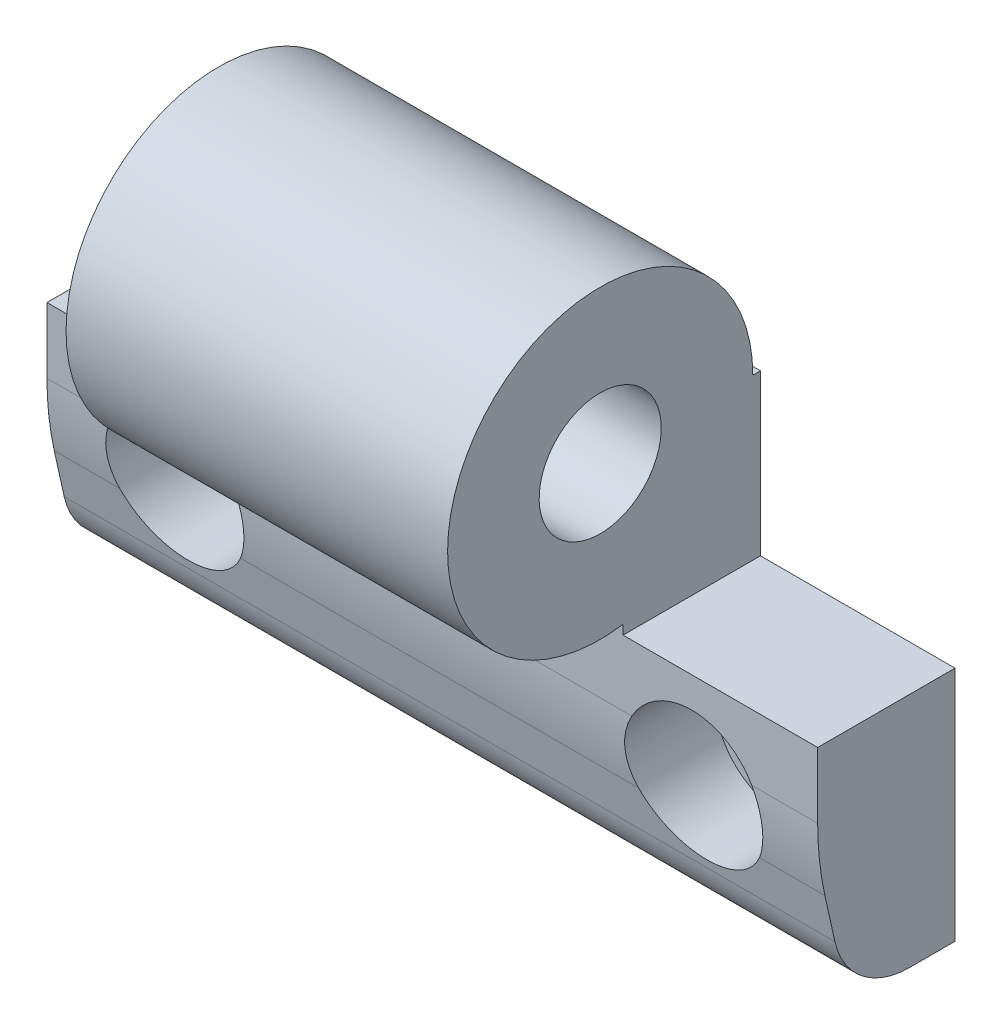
ISO-10303-21;
HEADER;
FILE_DESCRIPTION(('STEP AP214'),'2;1');
FILE_NAME('part.step','',(''),(''),'','','');
FILE_SCHEMA(('AUTOMOTIVE_DESIGN { 1 0 10303 214 1 1 1 1 }'));
ENDSEC;
DATA;
#1=APPLICATION_CONTEXT('core data for automotive mechanical design processes');
#2=APPLICATION_PROTOCOL_DEFINITION('international standard','automotive_design',2000,#1);
#3=PRODUCT_CONTEXT('',#1,'mechanical');
#4=PRODUCT('Part','Part','',(#3));
#5=PRODUCT_RELATED_PRODUCT_CATEGORY('part','',(#4));
#6=PRODUCT_DEFINITION_FORMATION('','',#4);
#7=PRODUCT_DEFINITION_CONTEXT('part definition',#1,'design');
#8=PRODUCT_DEFINITION('design','',#6,#7);
#9=PRODUCT_DEFINITION_SHAPE('','',#8);
#10=(LENGTH_UNIT() NAMED_UNIT(*) SI_UNIT(.MILLI.,.METRE.));
#11=(NAMED_UNIT(*) PLANE_ANGLE_UNIT() SI_UNIT($,.RADIAN.));
#12=(NAMED_UNIT(*) SI_UNIT($,.STERADIAN.) SOLID_ANGLE_UNIT());
#13=UNCERTAINTY_MEASURE_WITH_UNIT(LENGTH_MEASURE(1.E-05),#10,'distance_accuracy_value','');
#14=(GEOMETRIC_REPRESENTATION_CONTEXT(3) GLOBAL_UNCERTAINTY_ASSIGNED_CONTEXT((#13)) GLOBAL_UNIT_ASSIGNED_CONTEXT((#10,
#11,#12)) REPRESENTATION_CONTEXT('',''));
#15=CARTESIAN_POINT('',(0.,0.,0.));
#16=DIRECTION('',(0.,0.,1.));
#17=DIRECTION('',(1.,0.,0.));
#18=AXIS2_PLACEMENT_3D('',#15,#16,#17);
#19=CARTESIAN_POINT('',(43.5,2.19544457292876,-10.9999999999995));
#20=DIRECTION('',(-1.,0.,0.));
#21=DIRECTION('',(0.,-1.,0.));
#22=AXIS2_PLACEMENT_3D('',#19,#20,#21);
#23=CYLINDRICAL_SURFACE('',#22,19.9999999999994);
#24=CARTESIAN_POINT('',(30.0718931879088,2.19544457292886,9.));
#25=CARTESIAN_POINT('',(30.0112249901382,2.08692436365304,9.00000772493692));
#26=CARTESIAN_POINT('',(29.9550790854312,1.97587926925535,8.99911700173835));
#27=CARTESIAN_POINT('',(29.8521731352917,1.74955813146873,8.99534729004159));
#28=CARTESIAN_POINT('',(29.8054128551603,1.63428219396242,8.99246835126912));
#29=CARTESIAN_POINT('',(29.7217321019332,1.40063584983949,8.98454182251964));
#30=CARTESIAN_POINT('',(29.6847848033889,1.28227487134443,8.97950024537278));
#31=CARTESIAN_POINT('',(29.6208009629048,1.04305545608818,8.96713248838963));
#32=CARTESIAN_POINT('',(29.5937641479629,0.922197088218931,8.95980637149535));
#33=CARTESIAN_POINT('',(29.5277604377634,0.556948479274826,8.93425805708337));
#34=CARTESIAN_POINT('',(29.5039054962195,0.309899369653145,8.91246636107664));
#35=CARTESIAN_POINT('',(29.496976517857,-0.183901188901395,8.85951756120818));
#36=CARTESIAN_POINT('',(29.5139312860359,-0.430652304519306,8.82835385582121));
#37=CARTESIAN_POINT('',(29.5702101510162,-0.802504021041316,8.77446354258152));
#38=CARTESIAN_POINT('',(29.5953000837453,-0.930344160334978,8.75464210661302));
#39=CARTESIAN_POINT('',(29.656367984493,-1.1831099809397,8.71298410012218));
#40=CARTESIAN_POINT('',(29.6923473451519,-1.30803528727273,8.69114727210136));
#41=CARTESIAN_POINT('',(29.7748952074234,-1.55414052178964,8.64576985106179));
#42=CARTESIAN_POINT('',(29.8214736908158,-1.67531679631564,8.6222276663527));
#43=CARTESIAN_POINT('',(29.9247856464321,-1.91296483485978,8.57385420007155));
#44=CARTESIAN_POINT('',(29.9815171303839,-2.02943751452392,8.54902317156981));
#45=CARTESIAN_POINT('',(30.0431267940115,-2.14316458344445,8.52374120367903));
#46=B_SPLINE_CURVE_WITH_KNOTS('',3,(#24,#25,#26,#27,#28,#29,#30,#31,#32,#33,#34,#35,#36,#37,#38,
#39,#40,#41,#42,#43,#44,#45),.UNSPECIFIED.,.F.,.F.,(4,2,2,2,2,2,2,2,2,2,4),(0.,
0.372866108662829,0.745722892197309,1.11754966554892,1.48936619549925,2.23304529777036,
2.97724947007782,3.37215823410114,3.7671175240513,4.16245031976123,4.55770578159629),.UNSPECIFIED.);
#47=CARTESIAN_POINT('',(30.0718931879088,2.19544457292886,9.));
#48=VERTEX_POINT('',#47);
#49=CARTESIAN_POINT('',(30.0431267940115,-2.14316458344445,8.52374120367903));
#50=VERTEX_POINT('',#49);
#51=EDGE_CURVE('E126',#48,#50,#46,.T.);
#52=ORIENTED_EDGE('',*,*,#51,.F.);
#53=DIRECTION('',(-1.,0.,0.));
#54=VECTOR('',#53,1.);
#55=CARTESIAN_POINT('',(43.5,2.19544457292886,9.));
#56=LINE('',#55,#54);
#57=CARTESIAN_POINT('',(3.9281068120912,2.19544457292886,9.));
#58=VERTEX_POINT('',#57);
#59=EDGE_CURVE('E36',#48,#58,#56,.T.);
#60=ORIENTED_EDGE('',*,*,#59,.T.);
#61=CARTESIAN_POINT('',(3.95687320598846,-2.14316458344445,8.52374120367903));
#62=CARTESIAN_POINT('',(4.01660703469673,-2.03290070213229,8.54825287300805));
#63=CARTESIAN_POINT('',(4.07175599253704,-1.92005304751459,8.57234171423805));
#64=CARTESIAN_POINT('',(4.17252019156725,-1.68992066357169,8.61931803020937));
#65=CARTESIAN_POINT('',(4.21813419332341,-1.5726353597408,8.64220534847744));
#66=CARTESIAN_POINT('',(4.29943126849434,-1.334438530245,8.68640682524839));
#67=CARTESIAN_POINT('',(4.33511861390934,-1.21352858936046,8.70772165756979));
#68=CARTESIAN_POINT('',(4.39627456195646,-0.968849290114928,8.7484839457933));
#69=CARTESIAN_POINT('',(4.42174380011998,-0.845080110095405,8.76793151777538));
#70=CARTESIAN_POINT('',(4.46224845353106,-0.595295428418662,8.80474026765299));
#71=CARTESIAN_POINT('',(4.47726432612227,-0.469276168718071,8.82209748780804));
#72=CARTESIAN_POINT('',(4.49659922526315,-0.216123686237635,8.85448616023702));
#73=CARTESIAN_POINT('',(4.50091849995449,-0.0889904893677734,8.86951766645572));
#74=CARTESIAN_POINT('',(4.49875711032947,0.165403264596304,8.89711776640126));
#75=CARTESIAN_POINT('',(4.49228061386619,0.292663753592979,8.90968730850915));
#76=CARTESIAN_POINT('',(4.46852718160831,0.546337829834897,8.93230178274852));
#77=CARTESIAN_POINT('',(4.45125551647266,0.672751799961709,8.94234794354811));
#78=CARTESIAN_POINT('',(4.4066510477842,0.920202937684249,8.95967676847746));
#79=CARTESIAN_POINT('',(4.37962254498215,1.04129006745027,8.96703073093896));
#80=CARTESIAN_POINT('',(4.31562303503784,1.28092962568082,8.97944103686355));
#81=CARTESIAN_POINT('',(4.27865198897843,1.39948204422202,8.98449737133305));
#82=CARTESIAN_POINT('',(4.19490150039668,1.63348536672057,8.99244659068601));
#83=CARTESIAN_POINT('',(4.14809727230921,1.74892758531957,8.99533392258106));
#84=CARTESIAN_POINT('',(4.045076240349,1.9755734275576,8.99911477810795));
#85=CARTESIAN_POINT('',(3.98885899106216,2.0867768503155,9.00000820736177));
#86=CARTESIAN_POINT('',(3.9281068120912,2.19544457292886,9.));
#87=B_SPLINE_CURVE_WITH_KNOTS('',3,(#61,#62,#63,#64,#65,#66,#67,#68,#69,#70,#71,#72,#73,#74,#75,
#76,#77,#78,#79,#80,#81,#82,#83,#84,#85,#86),.UNSPECIFIED.,.F.,.F.,(4,2,2,2,2,2,2,2,2,2,2,2,4),
(0.,0.383232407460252,0.766514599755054,1.1496315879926,1.53272474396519,1.91653218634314,
2.3003307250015,2.68398112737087,3.06744436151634,3.43985642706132,3.81226995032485,
4.18563369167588,4.55901510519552),.UNSPECIFIED.);
#88=CARTESIAN_POINT('',(3.95687320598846,-2.14316458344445,8.52374120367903));
#89=VERTEX_POINT('',#88);
#90=EDGE_CURVE('E175',#89,#58,#87,.T.);
#91=ORIENTED_EDGE('',*,*,#90,.F.);
#92=DIRECTION('',(-1.,0.,0.));
#93=VECTOR('',#92,1.);
#94=CARTESIAN_POINT('',(43.5,-2.14316458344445,8.52374120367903));
#95=LINE('',#94,#93);
#96=EDGE_CURVE('E127',#50,#89,#95,.T.);
#97=ORIENTED_EDGE('',*,*,#96,.F.);
#98=EDGE_LOOP('',(#52,#60,#91,#97));
#99=FACE_BOUND('',#98,.T.);
#100=ADVANCED_FACE('F14',(#99),#23,.T.);
#101=CARTESIAN_POINT('',(37.9568732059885,-2.14316458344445,8.52374120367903));
#102=CARTESIAN_POINT('',(38.0166070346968,-2.03290070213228,8.54825287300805));
#103=CARTESIAN_POINT('',(38.071755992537,-1.92005304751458,8.57234171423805));
#104=CARTESIAN_POINT('',(38.1725201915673,-1.68992066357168,8.61931803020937));
#105=CARTESIAN_POINT('',(38.2181341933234,-1.5726353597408,8.64220534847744));
#106=CARTESIAN_POINT('',(38.2994312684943,-1.334438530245,8.68640682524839));
#107=CARTESIAN_POINT('',(38.3351186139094,-1.21352858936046,8.7077216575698));
#108=CARTESIAN_POINT('',(38.3962745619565,-0.96884929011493,8.7484839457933));
#109=CARTESIAN_POINT('',(38.42174380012,-0.845080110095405,8.76793151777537));
#110=CARTESIAN_POINT('',(38.4622484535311,-0.595295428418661,8.80474026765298));
#111=CARTESIAN_POINT('',(38.4772643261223,-0.469276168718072,8.82209748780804));
#112=CARTESIAN_POINT('',(38.4965992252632,-0.216123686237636,8.85448616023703));
#113=CARTESIAN_POINT('',(38.5009184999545,-0.0889904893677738,8.86951766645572));
#114=CARTESIAN_POINT('',(38.4987571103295,0.165403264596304,8.89711776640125));
#115=CARTESIAN_POINT('',(38.4922806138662,0.292663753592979,8.90968730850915));
#116=CARTESIAN_POINT('',(38.4685271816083,0.546337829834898,8.93230178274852));
#117=CARTESIAN_POINT('',(38.4512555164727,0.672751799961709,8.94234794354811));
#118=CARTESIAN_POINT('',(38.4066510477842,0.920202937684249,8.95967676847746));
#119=CARTESIAN_POINT('',(38.3796225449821,1.04129006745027,8.96703073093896));
#120=CARTESIAN_POINT('',(38.3156230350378,1.28092962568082,8.97944103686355));
#121=CARTESIAN_POINT('',(38.2786519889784,1.39948204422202,8.98449737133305));
#122=CARTESIAN_POINT('',(38.1949015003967,1.63348536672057,8.99244659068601));
#123=CARTESIAN_POINT('',(38.1480972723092,1.74892758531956,8.99533392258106));
#124=CARTESIAN_POINT('',(38.045076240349,1.97557342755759,8.99911477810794));
#125=CARTESIAN_POINT('',(37.9888589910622,2.0867768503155,9.00000820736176));
#126=CARTESIAN_POINT('',(37.9281068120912,2.19544457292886,9.));
#127=B_SPLINE_CURVE_WITH_KNOTS('',3,(#101,#102,#103,#104,#105,#106,#107,#108,#109,#110,#111,
#112,#113,#114,#115,#116,#117,#118,#119,#120,#121,#122,#123,#124,#125,#126),.UNSPECIFIED.,.F.,
.F.,(4,2,2,2,2,2,2,2,2,2,2,2,4),(0.,0.383232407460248,0.766514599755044,1.14963158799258,
1.53272474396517,1.91653218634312,2.30033072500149,2.68398112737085,3.06744436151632,
3.4398564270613,3.81226995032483,4.18563369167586,4.55901510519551),.UNSPECIFIED.);
#128=CARTESIAN_POINT('',(37.9568732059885,-2.14316458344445,8.52374120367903));
#129=VERTEX_POINT('',#128);
#130=CARTESIAN_POINT('',(37.9281068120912,2.19544457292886,9.));
#131=VERTEX_POINT('',#130);
#132=EDGE_CURVE('E28',#129,#131,#127,.T.);
#133=ORIENTED_EDGE('',*,*,#132,.F.);
#134=CARTESIAN_POINT('',(42.25,-2.14316458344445,8.52374120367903));
#135=VERTEX_POINT('',#134);
#136=EDGE_CURVE('E144',#135,#129,#95,.T.);
#137=ORIENTED_EDGE('',*,*,#136,.F.);
#138=CARTESIAN_POINT('',(42.25,2.19544457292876,-10.9999999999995));
#139=DIRECTION('',(1.,0.,0.));
#140=DIRECTION('',(0.,1.,0.));
#141=AXIS2_PLACEMENT_3D('',#138,#139,#140);
#142=CIRCLE('',#141,19.9999999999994);
#143=CARTESIAN_POINT('',(42.25,2.19544457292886,9.));
#144=VERTEX_POINT('',#143);
#145=EDGE_CURVE('E200',#144,#135,#142,.T.);
#146=ORIENTED_EDGE('',*,*,#145,.F.);
#147=EDGE_CURVE('E140',#144,#131,#56,.T.);
#148=ORIENTED_EDGE('',*,*,#147,.T.);
#149=EDGE_LOOP('',(#133,#137,#146,#148));
#150=FACE_BOUND('',#149,.T.);
#151=ADVANCED_FACE('F233',(#150),#23,.T.);
#152=CARTESIAN_POINT('',(-3.9281068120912,2.19544457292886,9.));
#153=CARTESIAN_POINT('',(-3.98877500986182,2.08692436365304,9.00000772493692));
#154=CARTESIAN_POINT('',(-4.04492091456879,1.97587926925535,8.99911700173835));
#155=CARTESIAN_POINT('',(-4.1478268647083,1.74955813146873,8.99534729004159));
#156=CARTESIAN_POINT('',(-4.19458714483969,1.63428219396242,8.99246835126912));
#157=CARTESIAN_POINT('',(-4.2782678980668,1.40063584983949,8.98454182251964));
#158=CARTESIAN_POINT('',(-4.31521519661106,1.28227487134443,8.97950024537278));
#159=CARTESIAN_POINT('',(-4.37919903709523,1.04305545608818,8.96713248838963));
#160=CARTESIAN_POINT('',(-4.40623585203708,0.92219708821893,8.95980637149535));
#161=CARTESIAN_POINT('',(-4.47223956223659,0.556948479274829,8.93425805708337));
#162=CARTESIAN_POINT('',(-4.49609450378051,0.309899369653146,8.91246636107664));
#163=CARTESIAN_POINT('',(-4.50302348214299,-0.183901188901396,8.85951756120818));
#164=CARTESIAN_POINT('',(-4.48606871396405,-0.430652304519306,8.82835385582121));
#165=CARTESIAN_POINT('',(-4.42978984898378,-0.802504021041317,8.77446354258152));
#166=CARTESIAN_POINT('',(-4.40469991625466,-0.930344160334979,8.75464210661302));
#167=CARTESIAN_POINT('',(-4.34363201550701,-1.1831099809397,8.71298410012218));
#168=CARTESIAN_POINT('',(-4.30765265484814,-1.30803528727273,8.69114727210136));
#169=CARTESIAN_POINT('',(-4.22510479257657,-1.55414052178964,8.64576985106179));
#170=CARTESIAN_POINT('',(-4.17852630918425,-1.67531679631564,8.6222276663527));
#171=CARTESIAN_POINT('',(-4.07521435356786,-1.91296483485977,8.57385420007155));
#172=CARTESIAN_POINT('',(-4.01848286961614,-2.02943751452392,8.54902317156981));
#173=CARTESIAN_POINT('',(-3.95687320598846,-2.14316458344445,8.52374120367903));
#174=B_SPLINE_CURVE_WITH_KNOTS('',3,(#152,#153,#154,#155,#156,#157,#158,#159,#160,#161,#162,
#163,#164,#165,#166,#167,#168,#169,#170,#171,#172,#173),.UNSPECIFIED.,.F.,.F.,(4,2,2,2,2,2,2,2,
2,2,4),(0.,0.372866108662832,0.745722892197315,1.11754966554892,1.48936619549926,
2.23304529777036,2.97724947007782,3.37215823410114,3.76711752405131,4.16245031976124,
4.55770578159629),.UNSPECIFIED.);
#175=CARTESIAN_POINT('',(-3.9281068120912,2.19544457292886,9.));
#176=VERTEX_POINT('',#175);
#177=CARTESIAN_POINT('',(-3.95687320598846,-2.14316458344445,8.52374120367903));
#178=VERTEX_POINT('',#177);
#179=EDGE_CURVE('E173',#176,#178,#174,.T.);
#180=ORIENTED_EDGE('',*,*,#179,.F.);
#181=CARTESIAN_POINT('',(-8.25,2.19544457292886,9.));
#182=VERTEX_POINT('',#181);
#183=EDGE_CURVE('E141',#176,#182,#56,.T.);
#184=ORIENTED_EDGE('',*,*,#183,.T.);
#185=CARTESIAN_POINT('',(-8.25,2.19544457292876,-10.9999999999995));
#186=DIRECTION('',(-1.,0.,0.));
#187=DIRECTION('',(0.,-1.,0.));
#188=AXIS2_PLACEMENT_3D('',#185,#186,#187);
#189=CIRCLE('',#188,19.9999999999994);
#190=CARTESIAN_POINT('',(-8.25,-2.14316458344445,8.52374120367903));
#191=VERTEX_POINT('',#190);
#192=EDGE_CURVE('E184',#191,#182,#189,.T.);
#193=ORIENTED_EDGE('',*,*,#192,.F.);
#194=EDGE_CURVE('E221',#178,#191,#95,.T.);
#195=ORIENTED_EDGE('',*,*,#194,.F.);
#196=EDGE_LOOP('',(#180,#184,#193,#195));
#197=FACE_BOUND('',#196,.T.);
#198=ADVANCED_FACE('F182',(#197),#23,.T.);
#199=CARTESIAN_POINT('',(43.5,-2.14316458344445,8.52374120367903));
#200=DIRECTION('',(0.,0.216930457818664,-0.976187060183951));
#201=DIRECTION('',(0.,0.976187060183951,0.216930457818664));
#202=AXIS2_PLACEMENT_3D('',#199,#200,#201);
#203=PLANE('',#202);
#204=CARTESIAN_POINT('',(34.,0.,9.));
#205=DIRECTION('',(0.,0.216930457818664,-0.976187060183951));
#206=DIRECTION('',(0.,-0.976187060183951,-0.216930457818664));
#207=AXIS2_PLACEMENT_3D('',#204,#205,#206);
#208=ELLIPSE('',#207,4.60977222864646,4.5);
#209=EDGE_CURVE('E130',#50,#129,#208,.F.);
#210=ORIENTED_EDGE('',*,*,#209,.F.);
#211=ORIENTED_EDGE('',*,*,#96,.T.);
#212=CARTESIAN_POINT('',(0.,0.,9.));
#213=DIRECTION('',(0.,0.216930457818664,-0.976187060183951));
#214=DIRECTION('',(0.,-0.976187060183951,-0.216930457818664));
#215=AXIS2_PLACEMENT_3D('',#212,#213,#214);
#216=ELLIPSE('',#215,4.60977222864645,4.5);
#217=EDGE_CURVE('E291',#178,#89,#216,.F.);
#218=ORIENTED_EDGE('',*,*,#217,.F.);
#219=ORIENTED_EDGE('',*,*,#194,.T.);
#220=DIRECTION('',(0.,0.976187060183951,0.216930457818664));
#221=VECTOR('',#220,1.);
#222=CARTESIAN_POINT('',(-8.25,-2.14316458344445,8.52374120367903));
#223=LINE('',#222,#221);
#224=CARTESIAN_POINT('',(-8.25,-5.0846522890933,7.87007726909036));
#225=VERTEX_POINT('',#224);
#226=EDGE_CURVE('E162',#225,#191,#223,.T.);
#227=ORIENTED_EDGE('',*,*,#226,.F.);
#228=DIRECTION('',(-1.,0.,0.));
#229=VECTOR('',#228,1.);
#230=CARTESIAN_POINT('',(43.5,-5.0846522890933,7.87007726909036));
#231=LINE('',#230,#229);
#232=CARTESIAN_POINT('',(42.25,-5.0846522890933,7.87007726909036));
#233=VERTEX_POINT('',#232);
#234=EDGE_CURVE('E219',#233,#225,#231,.T.);
#235=ORIENTED_EDGE('',*,*,#234,.F.);
#236=DIRECTION('',(0.,-0.976187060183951,-0.216930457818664));
#237=VECTOR('',#236,1.);
#238=CARTESIAN_POINT('',(42.25,-2.14316458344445,8.52374120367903));
#239=LINE('',#238,#237);
#240=EDGE_CURVE('E165',#135,#233,#239,.T.);
#241=ORIENTED_EDGE('',*,*,#240,.F.);
#242=ORIENTED_EDGE('',*,*,#136,.T.);
#243=EDGE_LOOP('',(#210,#211,#218,#219,#227,#235,#241,#242));
#244=FACE_BOUND('',#243,.T.);
#245=ADVANCED_FACE('F230',(#244),#203,.F.);
#246=CARTESIAN_POINT('',(43.5,7.11314003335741,9.));
#247=DIRECTION('',(0.,0.,-1.));
#248=DIRECTION('',(-1.,0.,0.));
#249=AXIS2_PLACEMENT_3D('',#246,#247,#248);
#250=PLANE('',#249);
#251=CARTESIAN_POINT('',(34.,0.,9.));
#252=DIRECTION('',(0.,0.,-1.));
#253=DIRECTION('',(-1.,0.,0.));
#254=AXIS2_PLACEMENT_3D('',#251,#252,#253);
#255=CIRCLE('',#254,4.5);
#256=EDGE_CURVE('E9',#131,#48,#255,.F.);
#257=ORIENTED_EDGE('',*,*,#256,.F.);
#258=ORIENTED_EDGE('',*,*,#147,.F.);
#259=DIRECTION('',(0.,-1.,0.));
#260=VECTOR('',#259,1.);
#261=CARTESIAN_POINT('',(42.25,7.11314003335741,9.));
#262=LINE('',#261,#260);
#263=CARTESIAN_POINT('',(42.25,6.5,9.));
#264=VERTEX_POINT('',#263);
#265=EDGE_CURVE('E202',#264,#144,#262,.T.);
#266=ORIENTED_EDGE('',*,*,#265,.F.);
#267=DIRECTION('',(1.,0.,0.));
#268=VECTOR('',#267,1.);
#269=CARTESIAN_POINT('',(43.5,6.5,9.));
#270=LINE('',#269,#268);
#271=CARTESIAN_POINT('',(29.5,6.5,9.));
#272=VERTEX_POINT('',#271);
#273=EDGE_CURVE('E167',#272,#264,#270,.T.);
#274=ORIENTED_EDGE('',*,*,#273,.F.);
#275=DIRECTION('',(0.,-1.,0.));
#276=VECTOR('',#275,1.);
#277=CARTESIAN_POINT('',(29.5,7.11314003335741,9.));
#278=LINE('',#277,#276);
#279=CARTESIAN_POINT('',(29.5,7.11314003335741,9.));
#280=VERTEX_POINT('',#279);
#281=EDGE_CURVE('E208',#280,#272,#278,.T.);
#282=ORIENTED_EDGE('',*,*,#281,.F.);
#283=DIRECTION('',(-1.,0.,0.));
#284=VECTOR('',#283,1.);
#285=CARTESIAN_POINT('',(43.5,7.11314003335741,9.));
#286=LINE('',#285,#284);
#287=CARTESIAN_POINT('',(4.5,7.11314003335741,9.));
#288=VERTEX_POINT('',#287);
#289=EDGE_CURVE('E143',#280,#288,#286,.T.);
#290=ORIENTED_EDGE('',*,*,#289,.T.);
#291=DIRECTION('',(0.,1.,0.));
#292=VECTOR('',#291,1.);
#293=CARTESIAN_POINT('',(4.5,7.11314003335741,9.));
#294=LINE('',#293,#292);
#295=CARTESIAN_POINT('',(4.5,6.5,9.));
#296=VERTEX_POINT('',#295);
#297=EDGE_CURVE('E214',#296,#288,#294,.T.);
#298=ORIENTED_EDGE('',*,*,#297,.F.);
#299=DIRECTION('',(1.,0.,0.));
#300=VECTOR('',#299,1.);
#301=CARTESIAN_POINT('',(43.5,6.5,9.));
#302=LINE('',#301,#300);
#303=CARTESIAN_POINT('',(-8.25,6.5,9.));
#304=VERTEX_POINT('',#303);
#305=EDGE_CURVE('E169',#304,#296,#302,.T.);
#306=ORIENTED_EDGE('',*,*,#305,.F.);
#307=DIRECTION('',(0.,1.,0.));
#308=VECTOR('',#307,1.);
#309=CARTESIAN_POINT('',(-8.25,7.11314003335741,9.));
#310=LINE('',#309,#308);
#311=EDGE_CURVE('E178',#182,#304,#310,.T.);
#312=ORIENTED_EDGE('',*,*,#311,.F.);
#313=ORIENTED_EDGE('',*,*,#183,.F.);
#314=CARTESIAN_POINT('',(0.,0.,9.));
#315=DIRECTION('',(0.,0.,-1.));
#316=DIRECTION('',(-1.,0.,0.));
#317=AXIS2_PLACEMENT_3D('',#314,#315,#316);
#318=CIRCLE('',#317,4.5);
#319=EDGE_CURVE('E22',#58,#176,#318,.F.);
#320=ORIENTED_EDGE('',*,*,#319,.F.);
#321=ORIENTED_EDGE('',*,*,#59,.F.);
#322=EDGE_LOOP('',(#257,#258,#266,#274,#282,#290,#298,#306,#312,#313,#320,#321));
#323=FACE_BOUND('',#322,.T.);
#324=ADVANCED_FACE('F137',(#323),#250,.F.);
#325=CARTESIAN_POINT('',(43.5,17.,10.5));
#326=DIRECTION('',(-1.,0.,0.));
#327=DIRECTION('',(0.,-1.,0.));
#328=AXIS2_PLACEMENT_3D('',#325,#326,#327);
#329=CYLINDRICAL_SURFACE('',#328,10.);
#330=CARTESIAN_POINT('',(4.5,17.,10.5));
#331=DIRECTION('',(-1.,0.,0.));
#332=DIRECTION('',(0.,-1.,0.));
#333=AXIS2_PLACEMENT_3D('',#330,#331,#332);
#334=CIRCLE('',#333,10.);
#335=CARTESIAN_POINT('',(4.5,17.,0.5));
#336=VERTEX_POINT('',#335);
#337=EDGE_CURVE('E216',#288,#336,#334,.T.);
#338=ORIENTED_EDGE('',*,*,#337,.F.);
#339=ORIENTED_EDGE('',*,*,#289,.F.);
#340=CARTESIAN_POINT('',(29.5,17.,10.5));
#341=DIRECTION('',(1.,0.,0.));
#342=DIRECTION('',(0.,1.,0.));
#343=AXIS2_PLACEMENT_3D('',#340,#341,#342);
#344=CIRCLE('',#343,10.);
#345=CARTESIAN_POINT('',(29.5,17.,0.5));
#346=VERTEX_POINT('',#345);
#347=EDGE_CURVE('E210',#346,#280,#344,.T.);
#348=ORIENTED_EDGE('',*,*,#347,.F.);
#349=DIRECTION('',(-1.,0.,0.));
#350=VECTOR('',#349,1.);
#351=CARTESIAN_POINT('',(43.5,17.,0.5));
#352=LINE('',#351,#350);
#353=EDGE_CURVE('E150',#346,#336,#352,.T.);
#354=ORIENTED_EDGE('',*,*,#353,.T.);
#355=EDGE_LOOP('',(#338,#339,#348,#354));
#356=FACE_BOUND('',#355,.T.);
#357=ADVANCED_FACE('F350',(#356),#329,.T.);
#358=CARTESIAN_POINT('',(43.5,17.,0.));
#359=DIRECTION('',(0.,-1.,0.));
#360=DIRECTION('',(1.,0.,0.));
#361=AXIS2_PLACEMENT_3D('',#358,#359,#360);
#362=PLANE('',#361);
#363=DIRECTION('',(0.,0.,-1.));
#364=VECTOR('',#363,1.);
#365=CARTESIAN_POINT('',(4.5,17.,0.));
#366=LINE('',#365,#364);
#367=CARTESIAN_POINT('',(4.5,17.,0.));
#368=VERTEX_POINT('',#367);
#369=EDGE_CURVE('E218',#336,#368,#366,.T.);
#370=ORIENTED_EDGE('',*,*,#369,.F.);
#371=ORIENTED_EDGE('',*,*,#353,.F.);
#372=DIRECTION('',(0.,0.,1.));
#373=VECTOR('',#372,1.);
#374=CARTESIAN_POINT('',(29.5,17.,0.));
#375=LINE('',#374,#373);
#376=CARTESIAN_POINT('',(29.5,17.,0.));
#377=VERTEX_POINT('',#376);
#378=EDGE_CURVE('E212',#377,#346,#375,.T.);
#379=ORIENTED_EDGE('',*,*,#378,.F.);
#380=DIRECTION('',(-1.,0.,0.));
#381=VECTOR('',#380,1.);
#382=CARTESIAN_POINT('',(43.5,17.,0.));
#383=LINE('',#382,#381);
#384=EDGE_CURVE('E153',#377,#368,#383,.T.);
#385=ORIENTED_EDGE('',*,*,#384,.T.);
#386=EDGE_LOOP('',(#370,#371,#379,#385));
#387=FACE_BOUND('',#386,.T.);
#388=ADVANCED_FACE('F352',(#387),#362,.F.);
#389=CARTESIAN_POINT('',(43.5,-9.,0.));
#390=DIRECTION('',(0.,0.,1.));
#391=DIRECTION('',(1.,0.,0.));
#392=AXIS2_PLACEMENT_3D('',#389,#390,#391);
#393=PLANE('',#392);
#394=CARTESIAN_POINT('',(34.,0.,0.));
#395=DIRECTION('',(0.,0.,-1.));
#396=DIRECTION('',(-1.,0.,0.));
#397=AXIS2_PLACEMENT_3D('',#394,#395,#396);
#398=CIRCLE('',#397,2.6);
#399=CARTESIAN_POINT('',(31.4,0.,0.));
#400=VERTEX_POINT('',#399);
#401=EDGE_CURVE('E539',#400,#400,#398,.T.);
#402=ORIENTED_EDGE('',*,*,#401,.F.);
#403=EDGE_LOOP('',(#402));
#404=FACE_BOUND('',#403,.T.);
#405=CARTESIAN_POINT('',(0.,0.,0.));
#406=DIRECTION('',(0.,0.,-1.));
#407=DIRECTION('',(-1.,0.,0.));
#408=AXIS2_PLACEMENT_3D('',#405,#406,#407);
#409=CIRCLE('',#408,2.6);
#410=CARTESIAN_POINT('',(-2.6,0.,0.));
#411=VERTEX_POINT('',#410);
#412=EDGE_CURVE('E129',#411,#411,#409,.T.);
#413=ORIENTED_EDGE('',*,*,#412,.F.);
#414=EDGE_LOOP('',(#413));
#415=FACE_BOUND('',#414,.T.);
#416=DIRECTION('',(0.,1.,0.));
#417=VECTOR('',#416,1.);
#418=CARTESIAN_POINT('',(-8.25,-13.,0.));
#419=LINE('',#418,#417);
#420=CARTESIAN_POINT('',(-8.25,-9.,0.));
#421=VERTEX_POINT('',#420);
#422=CARTESIAN_POINT('',(-8.25,6.5,0.));
#423=VERTEX_POINT('',#422);
#424=EDGE_CURVE('E295',#421,#423,#419,.T.);
#425=ORIENTED_EDGE('',*,*,#424,.T.);
#426=DIRECTION('',(1.,0.,0.));
#427=VECTOR('',#426,1.);
#428=CARTESIAN_POINT('',(-8.25,6.5,0.));
#429=LINE('',#428,#427);
#430=CARTESIAN_POINT('',(4.5,6.5,0.));
#431=VERTEX_POINT('',#430);
#432=EDGE_CURVE('E298',#423,#431,#429,.T.);
#433=ORIENTED_EDGE('',*,*,#432,.T.);
#434=DIRECTION('',(0.,1.,0.));
#435=VECTOR('',#434,1.);
#436=CARTESIAN_POINT('',(4.5,6.5,0.));
#437=LINE('',#436,#435);
#438=EDGE_CURVE('E301',#431,#368,#437,.T.);
#439=ORIENTED_EDGE('',*,*,#438,.T.);
#440=ORIENTED_EDGE('',*,*,#384,.F.);
#441=DIRECTION('',(0.,-1.,0.));
#442=VECTOR('',#441,1.);
#443=CARTESIAN_POINT('',(29.5,27.5,0.));
#444=LINE('',#443,#442);
#445=CARTESIAN_POINT('',(29.5,6.5,0.));
#446=VERTEX_POINT('',#445);
#447=EDGE_CURVE('E304',#377,#446,#444,.T.);
#448=ORIENTED_EDGE('',*,*,#447,.T.);
#449=DIRECTION('',(1.,0.,0.));
#450=VECTOR('',#449,1.);
#451=CARTESIAN_POINT('',(29.5,6.5,0.));
#452=LINE('',#451,#450);
#453=CARTESIAN_POINT('',(42.25,6.5,0.));
#454=VERTEX_POINT('',#453);
#455=EDGE_CURVE('E307',#446,#454,#452,.T.);
#456=ORIENTED_EDGE('',*,*,#455,.T.);
#457=DIRECTION('',(0.,-1.,0.));
#458=VECTOR('',#457,1.);
#459=CARTESIAN_POINT('',(42.25,6.5,0.));
#460=LINE('',#459,#458);
#461=CARTESIAN_POINT('',(42.25,-9.,0.));
#462=VERTEX_POINT('',#461);
#463=EDGE_CURVE('E290',#454,#462,#460,.T.);
#464=ORIENTED_EDGE('',*,*,#463,.T.);
#465=DIRECTION('',(-1.,0.,0.));
#466=VECTOR('',#465,1.);
#467=CARTESIAN_POINT('',(43.5,-9.,0.));
#468=LINE('',#467,#466);
#469=EDGE_CURVE('E156',#462,#421,#468,.T.);
#470=ORIENTED_EDGE('',*,*,#469,.T.);
#471=EDGE_LOOP('',(#425,#433,#439,#440,#448,#456,#464,#470));
#472=FACE_BOUND('',#471,.T.);
#473=ADVANCED_FACE('F325',(#404,#415,#472),#393,.F.);
#474=CARTESIAN_POINT('',(43.5,-9.,2.98914196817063));
#475=DIRECTION('',(0.,1.,0.));
#476=DIRECTION('',(-1.,0.,0.));
#477=AXIS2_PLACEMENT_3D('',#474,#475,#476);
#478=PLANE('',#477);
#479=DIRECTION('',(0.,0.,-1.));
#480=VECTOR('',#479,1.);
#481=CARTESIAN_POINT('',(42.25,-9.,2.98914196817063));
#482=LINE('',#481,#480);
#483=CARTESIAN_POINT('',(42.25,-9.,2.98914196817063));
#484=VERTEX_POINT('',#483);
#485=EDGE_CURVE('E206',#484,#462,#482,.T.);
#486=ORIENTED_EDGE('',*,*,#485,.F.);
#487=DIRECTION('',(-1.,0.,0.));
#488=VECTOR('',#487,1.);
#489=CARTESIAN_POINT('',(43.5,-9.,2.98914196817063));
#490=LINE('',#489,#488);
#491=CARTESIAN_POINT('',(-8.25,-9.,2.98914196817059));
#492=VERTEX_POINT('',#491);
#493=EDGE_CURVE('E159',#484,#492,#490,.T.);
#494=ORIENTED_EDGE('',*,*,#493,.T.);
#495=DIRECTION('',(0.,0.,1.));
#496=VECTOR('',#495,1.);
#497=CARTESIAN_POINT('',(-8.25,-9.,2.98914196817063));
#498=LINE('',#497,#496);
#499=EDGE_CURVE('E198',#421,#492,#498,.T.);
#500=ORIENTED_EDGE('',*,*,#499,.F.);
#501=ORIENTED_EDGE('',*,*,#469,.F.);
#502=EDGE_LOOP('',(#486,#494,#500,#501));
#503=FACE_BOUND('',#502,.T.);
#504=ADVANCED_FACE('F330',(#503),#478,.F.);
#505=CARTESIAN_POINT('',(43.5,-4.,2.98914196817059));
#506=DIRECTION('',(-1.,0.,0.));
#507=DIRECTION('',(0.,-1.,0.));
#508=AXIS2_PLACEMENT_3D('',#505,#506,#507);
#509=CYLINDRICAL_SURFACE('',#508,5.);
#510=CARTESIAN_POINT('',(42.25,-4.,2.98914196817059));
#511=DIRECTION('',(1.,0.,0.));
#512=DIRECTION('',(0.,1.,0.));
#513=AXIS2_PLACEMENT_3D('',#510,#511,#512);
#514=CIRCLE('',#513,5.);
#515=EDGE_CURVE('E204',#233,#484,#514,.T.);
#516=ORIENTED_EDGE('',*,*,#515,.F.);
#517=ORIENTED_EDGE('',*,*,#234,.T.);
#518=CARTESIAN_POINT('',(-8.25,-4.,2.98914196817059));
#519=DIRECTION('',(-1.,0.,0.));
#520=DIRECTION('',(0.,-1.,0.));
#521=AXIS2_PLACEMENT_3D('',#518,#519,#520);
#522=CIRCLE('',#521,5.);
#523=EDGE_CURVE('E191',#492,#225,#522,.T.);
#524=ORIENTED_EDGE('',*,*,#523,.F.);
#525=ORIENTED_EDGE('',*,*,#493,.F.);
#526=EDGE_LOOP('',(#516,#517,#524,#525));
#527=FACE_BOUND('',#526,.T.);
#528=ADVANCED_FACE('F16',(#527),#509,.T.);
#529=CARTESIAN_POINT('',(4.5,6.5,53.));
#530=DIRECTION('',(-1.,0.,0.));
#531=DIRECTION('',(0.,-1.,0.));
#532=AXIS2_PLACEMENT_3D('',#529,#530,#531);
#533=PLANE('',#532);
#534=ORIENTED_EDGE('',*,*,#369,.T.);
#535=ORIENTED_EDGE('',*,*,#438,.F.);
#536=DIRECTION('',(0.,0.,-1.));
#537=VECTOR('',#536,1.);
#538=CARTESIAN_POINT('',(4.5,6.5,53.));
#539=LINE('',#538,#537);
#540=EDGE_CURVE('E193',#296,#431,#539,.T.);
#541=ORIENTED_EDGE('',*,*,#540,.F.);
#542=ORIENTED_EDGE('',*,*,#297,.T.);
#543=ORIENTED_EDGE('',*,*,#337,.T.);
#544=EDGE_LOOP('',(#534,#535,#541,#542,#543));
#545=FACE_BOUND('',#544,.T.);
#546=CARTESIAN_POINT('',(4.5,17.,10.5));
#547=DIRECTION('',(-1.,0.,0.));
#548=DIRECTION('',(0.,-1.,0.));
#549=AXIS2_PLACEMENT_3D('',#546,#547,#548);
#550=CIRCLE('',#549,4.);
#551=CARTESIAN_POINT('',(4.5,13.,10.5));
#552=VERTEX_POINT('',#551);
#553=EDGE_CURVE('E538',#552,#552,#550,.F.);
#554=ORIENTED_EDGE('',*,*,#553,.T.);
#555=EDGE_LOOP('',(#554));
#556=FACE_BOUND('',#555,.T.);
#557=ADVANCED_FACE('F320',(#545,#556),#533,.T.);
#558=CARTESIAN_POINT('',(-8.25,-13.,53.));
#559=DIRECTION('',(-1.,0.,0.));
#560=DIRECTION('',(0.,-1.,0.));
#561=AXIS2_PLACEMENT_3D('',#558,#559,#560);
#562=PLANE('',#561);
#563=ORIENTED_EDGE('',*,*,#499,.T.);
#564=ORIENTED_EDGE('',*,*,#523,.T.);
#565=ORIENTED_EDGE('',*,*,#226,.T.);
#566=ORIENTED_EDGE('',*,*,#192,.T.);
#567=ORIENTED_EDGE('',*,*,#311,.T.);
#568=DIRECTION('',(0.,0.,-1.));
#569=VECTOR('',#568,1.);
#570=CARTESIAN_POINT('',(-8.25,6.5,53.));
#571=LINE('',#570,#569);
#572=EDGE_CURVE('E189',#304,#423,#571,.T.);
#573=ORIENTED_EDGE('',*,*,#572,.T.);
#574=ORIENTED_EDGE('',*,*,#424,.F.);
#575=EDGE_LOOP('',(#563,#564,#565,#566,#567,#573,#574));
#576=FACE_BOUND('',#575,.T.);
#577=ADVANCED_FACE('F186',(#576),#562,.T.);
#578=CARTESIAN_POINT('',(-8.25,6.5,53.));
#579=DIRECTION('',(0.,1.,0.));
#580=DIRECTION('',(-1.,0.,0.));
#581=AXIS2_PLACEMENT_3D('',#578,#579,#580);
#582=PLANE('',#581);
#583=ORIENTED_EDGE('',*,*,#305,.T.);
#584=ORIENTED_EDGE('',*,*,#540,.T.);
#585=ORIENTED_EDGE('',*,*,#432,.F.);
#586=ORIENTED_EDGE('',*,*,#572,.F.);
#587=EDGE_LOOP('',(#583,#584,#585,#586));
#588=FACE_BOUND('',#587,.T.);
#589=ADVANCED_FACE('F317',(#588),#582,.T.);
#590=CARTESIAN_POINT('',(29.5,6.5,53.));
#591=DIRECTION('',(0.,1.,0.));
#592=DIRECTION('',(-1.,0.,0.));
#593=AXIS2_PLACEMENT_3D('',#590,#591,#592);
#594=PLANE('',#593);
#595=ORIENTED_EDGE('',*,*,#273,.T.);
#596=DIRECTION('',(0.,0.,-1.));
#597=VECTOR('',#596,1.);
#598=CARTESIAN_POINT('',(42.25,6.5,53.));
#599=LINE('',#598,#597);
#600=EDGE_CURVE('E310',#264,#454,#599,.T.);
#601=ORIENTED_EDGE('',*,*,#600,.T.);
#602=ORIENTED_EDGE('',*,*,#455,.F.);
#603=DIRECTION('',(0.,0.,-1.));
#604=VECTOR('',#603,1.);
#605=CARTESIAN_POINT('',(29.5,6.5,53.));
#606=LINE('',#605,#604);
#607=EDGE_CURVE('E312',#272,#446,#606,.T.);
#608=ORIENTED_EDGE('',*,*,#607,.F.);
#609=EDGE_LOOP('',(#595,#601,#602,#608));
#610=FACE_BOUND('',#609,.T.);
#611=ADVANCED_FACE('F275',(#610),#594,.T.);
#612=CARTESIAN_POINT('',(29.5,27.5,53.));
#613=DIRECTION('',(1.,0.,0.));
#614=DIRECTION('',(0.,1.,0.));
#615=AXIS2_PLACEMENT_3D('',#612,#613,#614);
#616=PLANE('',#615);
#617=ORIENTED_EDGE('',*,*,#378,.T.);
#618=ORIENTED_EDGE('',*,*,#347,.T.);
#619=ORIENTED_EDGE('',*,*,#281,.T.);
#620=ORIENTED_EDGE('',*,*,#607,.T.);
#621=ORIENTED_EDGE('',*,*,#447,.F.);
#622=EDGE_LOOP('',(#617,#618,#619,#620,#621));
#623=FACE_BOUND('',#622,.T.);
#624=CARTESIAN_POINT('',(29.5,17.,10.5));
#625=DIRECTION('',(1.,0.,0.));
#626=DIRECTION('',(0.,1.,0.));
#627=AXIS2_PLACEMENT_3D('',#624,#625,#626);
#628=CIRCLE('',#627,4.);
#629=CARTESIAN_POINT('',(29.5,21.,10.5));
#630=VERTEX_POINT('',#629);
#631=EDGE_CURVE('E535',#630,#630,#628,.T.);
#632=ORIENTED_EDGE('',*,*,#631,.F.);
#633=EDGE_LOOP('',(#632));
#634=FACE_BOUND('',#633,.T.);
#635=ADVANCED_FACE('F343',(#623,#634),#616,.T.);
#636=CARTESIAN_POINT('',(42.25,6.5,53.));
#637=DIRECTION('',(1.,0.,0.));
#638=DIRECTION('',(0.,1.,0.));
#639=AXIS2_PLACEMENT_3D('',#636,#637,#638);
#640=PLANE('',#639);
#641=ORIENTED_EDGE('',*,*,#485,.T.);
#642=ORIENTED_EDGE('',*,*,#463,.F.);
#643=ORIENTED_EDGE('',*,*,#600,.F.);
#644=ORIENTED_EDGE('',*,*,#265,.T.);
#645=ORIENTED_EDGE('',*,*,#145,.T.);
#646=ORIENTED_EDGE('',*,*,#240,.T.);
#647=ORIENTED_EDGE('',*,*,#515,.T.);
#648=EDGE_LOOP('',(#641,#642,#643,#644,#645,#646,#647));
#649=FACE_BOUND('',#648,.T.);
#650=ADVANCED_FACE('F273',(#649),#640,.T.);
#651=CARTESIAN_POINT('',(0.,0.,0.));
#652=DIRECTION('',(0.,0.,-1.));
#653=DIRECTION('',(-1.,0.,0.));
#654=AXIS2_PLACEMENT_3D('',#651,#652,#653);
#655=CYLINDRICAL_SURFACE('',#654,4.5);
#656=CARTESIAN_POINT('',(0.,0.,3.));
#657=DIRECTION('',(0.,0.,-1.));
#658=DIRECTION('',(-1.,0.,0.));
#659=AXIS2_PLACEMENT_3D('',#656,#657,#658);
#660=CIRCLE('',#659,4.5);
#661=CARTESIAN_POINT('',(-4.5,0.,3.));
#662=VERTEX_POINT('',#661);
#663=EDGE_CURVE('E556',#662,#662,#660,.T.);
#664=ORIENTED_EDGE('',*,*,#663,.T.);
#665=EDGE_LOOP('',(#664));
#666=FACE_BOUND('',#665,.T.);
#667=ORIENTED_EDGE('',*,*,#179,.T.);
#668=ORIENTED_EDGE('',*,*,#217,.T.);
#669=ORIENTED_EDGE('',*,*,#90,.T.);
#670=ORIENTED_EDGE('',*,*,#319,.T.);
#671=EDGE_LOOP('',(#667,#668,#669,#670));
#672=FACE_BOUND('',#671,.T.);
#673=ADVANCED_FACE('F171',(#666,#672),#655,.F.);
#674=CARTESIAN_POINT('',(-4.5,0.,3.));
#675=DIRECTION('',(0.,0.,1.));
#676=DIRECTION('',(1.,0.,0.));
#677=AXIS2_PLACEMENT_3D('',#674,#675,#676);
#678=PLANE('',#677);
#679=CARTESIAN_POINT('',(0.,0.,3.));
#680=DIRECTION('',(0.,0.,-1.));
#681=DIRECTION('',(-1.,0.,0.));
#682=AXIS2_PLACEMENT_3D('',#679,#680,#681);
#683=CIRCLE('',#682,2.6);
#684=CARTESIAN_POINT('',(-2.6,0.,3.));
#685=VERTEX_POINT('',#684);
#686=EDGE_CURVE('E553',#685,#685,#683,.T.);
#687=ORIENTED_EDGE('',*,*,#686,.T.);
#688=EDGE_LOOP('',(#687));
#689=FACE_BOUND('',#688,.T.);
#690=ORIENTED_EDGE('',*,*,#663,.F.);
#691=EDGE_LOOP('',(#690));
#692=FACE_BOUND('',#691,.T.);
#693=ADVANCED_FACE('F265',(#689,#692),#678,.T.);
#694=CARTESIAN_POINT('',(0.,0.,0.));
#695=DIRECTION('',(0.,0.,-1.));
#696=DIRECTION('',(-1.,0.,0.));
#697=AXIS2_PLACEMENT_3D('',#694,#695,#696);
#698=CYLINDRICAL_SURFACE('',#697,2.6);
#699=ORIENTED_EDGE('',*,*,#412,.T.);
#700=EDGE_LOOP('',(#699));
#701=FACE_BOUND('',#700,.T.);
#702=ORIENTED_EDGE('',*,*,#686,.F.);
#703=EDGE_LOOP('',(#702));
#704=FACE_BOUND('',#703,.T.);
#705=ADVANCED_FACE('F259',(#701,#704),#698,.F.);
#706=CARTESIAN_POINT('',(34.,0.,0.));
#707=DIRECTION('',(0.,0.,-1.));
#708=DIRECTION('',(-1.,0.,0.));
#709=AXIS2_PLACEMENT_3D('',#706,#707,#708);
#710=CYLINDRICAL_SURFACE('',#709,4.5);
#711=CARTESIAN_POINT('',(34.,0.,3.));
#712=DIRECTION('',(0.,0.,-1.));
#713=DIRECTION('',(-1.,0.,0.));
#714=AXIS2_PLACEMENT_3D('',#711,#712,#713);
#715=CIRCLE('',#714,4.5);
#716=CARTESIAN_POINT('',(29.5,0.,3.));
#717=VERTEX_POINT('',#716);
#718=EDGE_CURVE('E234',#717,#717,#715,.T.);
#719=ORIENTED_EDGE('',*,*,#718,.T.);
#720=EDGE_LOOP('',(#719));
#721=FACE_BOUND('',#720,.T.);
#722=ORIENTED_EDGE('',*,*,#51,.T.);
#723=ORIENTED_EDGE('',*,*,#209,.T.);
#724=ORIENTED_EDGE('',*,*,#132,.T.);
#725=ORIENTED_EDGE('',*,*,#256,.T.);
#726=EDGE_LOOP('',(#722,#723,#724,#725));
#727=FACE_BOUND('',#726,.T.);
#728=ADVANCED_FACE('F132',(#721,#727),#710,.F.);
#729=CARTESIAN_POINT('',(29.5,0.,3.));
#730=DIRECTION('',(0.,0.,1.));
#731=DIRECTION('',(1.,0.,0.));
#732=AXIS2_PLACEMENT_3D('',#729,#730,#731);
#733=PLANE('',#732);
#734=CARTESIAN_POINT('',(34.,0.,3.));
#735=DIRECTION('',(0.,0.,-1.));
#736=DIRECTION('',(-1.,0.,0.));
#737=AXIS2_PLACEMENT_3D('',#734,#735,#736);
#738=CIRCLE('',#737,2.6);
#739=CARTESIAN_POINT('',(31.4,0.,3.));
#740=VERTEX_POINT('',#739);
#741=EDGE_CURVE('E238',#740,#740,#738,.T.);
#742=ORIENTED_EDGE('',*,*,#741,.T.);
#743=EDGE_LOOP('',(#742));
#744=FACE_BOUND('',#743,.T.);
#745=ORIENTED_EDGE('',*,*,#718,.F.);
#746=EDGE_LOOP('',(#745));
#747=FACE_BOUND('',#746,.T.);
#748=ADVANCED_FACE('F258',(#744,#747),#733,.T.);
#749=CARTESIAN_POINT('',(34.,0.,0.));
#750=DIRECTION('',(0.,0.,-1.));
#751=DIRECTION('',(-1.,0.,0.));
#752=AXIS2_PLACEMENT_3D('',#749,#750,#751);
#753=CYLINDRICAL_SURFACE('',#752,2.6);
#754=ORIENTED_EDGE('',*,*,#401,.T.);
#755=EDGE_LOOP('',(#754));
#756=FACE_BOUND('',#755,.T.);
#757=ORIENTED_EDGE('',*,*,#741,.F.);
#758=EDGE_LOOP('',(#757));
#759=FACE_BOUND('',#758,.T.);
#760=ADVANCED_FACE('F487',(#756,#759),#753,.F.);
#761=CARTESIAN_POINT('',(-15.9187414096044,17.,10.5));
#762=DIRECTION('',(1.,0.,0.));
#763=DIRECTION('',(0.,1.,0.));
#764=AXIS2_PLACEMENT_3D('',#761,#762,#763);
#765=CYLINDRICAL_SURFACE('',#764,4.);
#766=ORIENTED_EDGE('',*,*,#631,.T.);
#767=EDGE_LOOP('',(#766));
#768=FACE_BOUND('',#767,.T.);
#769=ORIENTED_EDGE('',*,*,#553,.F.);
#770=EDGE_LOOP('',(#769));
#771=FACE_BOUND('',#770,.T.);
#772=ADVANCED_FACE('F496',(#768,#771),#765,.F.);
#773=CLOSED_SHELL('',(#100,#151,#198,#245,#324,#357,#388,#473,#504,#528,#557,#577,#589,#611,
#635,#650,#673,#693,#705,#728,#748,#760,#772));
#774=MANIFOLD_SOLID_BREP('B1',#773);
#775=ADVANCED_BREP_SHAPE_REPRESENTATION('',(#18,#774),#14);
#776=SHAPE_DEFINITION_REPRESENTATION(#9,#775);
ENDSEC;
END-ISO-10303-21;
